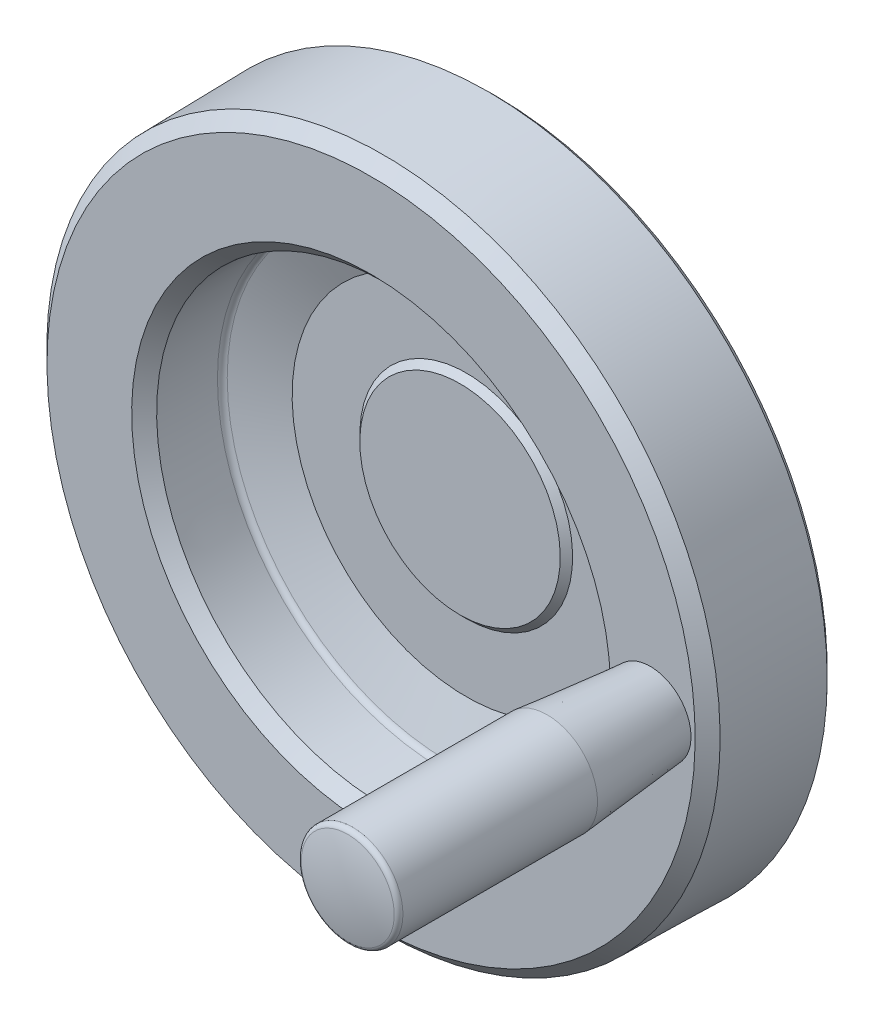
ISO-10303-21;
HEADER;
FILE_DESCRIPTION(('STEP AP214'),'2;1');
FILE_NAME('part.step','',(''),(''),'','','');
FILE_SCHEMA(('AUTOMOTIVE_DESIGN { 1 0 10303 214 1 1 1 1 }'));
ENDSEC;
DATA;
#1=APPLICATION_CONTEXT('core data for automotive mechanical design processes');
#2=APPLICATION_PROTOCOL_DEFINITION('international standard','automotive_design',2000,#1);
#3=PRODUCT_CONTEXT('',#1,'mechanical');
#4=PRODUCT('Part','Part','',(#3));
#5=PRODUCT_RELATED_PRODUCT_CATEGORY('part','',(#4));
#6=PRODUCT_DEFINITION_FORMATION('','',#4);
#7=PRODUCT_DEFINITION_CONTEXT('part definition',#1,'design');
#8=PRODUCT_DEFINITION('design','',#6,#7);
#9=PRODUCT_DEFINITION_SHAPE('','',#8);
#10=(LENGTH_UNIT() NAMED_UNIT(*) SI_UNIT(.MILLI.,.METRE.));
#11=(NAMED_UNIT(*) PLANE_ANGLE_UNIT() SI_UNIT($,.RADIAN.));
#12=(NAMED_UNIT(*) SI_UNIT($,.STERADIAN.) SOLID_ANGLE_UNIT());
#13=UNCERTAINTY_MEASURE_WITH_UNIT(LENGTH_MEASURE(1.E-05),#10,'distance_accuracy_value','');
#14=(GEOMETRIC_REPRESENTATION_CONTEXT(3) GLOBAL_UNCERTAINTY_ASSIGNED_CONTEXT((#13)) GLOBAL_UNIT_ASSIGNED_CONTEXT((#10,
#11,#12)) REPRESENTATION_CONTEXT('',''));
#15=CARTESIAN_POINT('',(0.,0.,0.));
#16=DIRECTION('',(0.,0.,1.));
#17=DIRECTION('',(1.,0.,0.));
#18=AXIS2_PLACEMENT_3D('',#15,#16,#17);
#19=CARTESIAN_POINT('',(72.5,0.,34.));
#20=DIRECTION('',(0.,0.,1.));
#21=DIRECTION('',(0.,1.,0.));
#22=AXIS2_PLACEMENT_3D('',#19,#20,#21);
#23=CYLINDRICAL_SURFACE('',#22,4.188);
#24=CARTESIAN_POINT('',(72.5,0.,49.1079999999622));
#25=DIRECTION('',(0.,0.,1.));
#26=DIRECTION('',(0.,1.,0.));
#27=AXIS2_PLACEMENT_3D('',#24,#25,#26);
#28=CIRCLE('',#27,4.188);
#29=CARTESIAN_POINT('',(72.5,4.188,49.1079999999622));
#30=VERTEX_POINT('',#29);
#31=EDGE_CURVE('E9',#30,#30,#28,.F.);
#32=ORIENTED_EDGE('',*,*,#31,.F.);
#33=EDGE_LOOP('',(#32));
#34=FACE_BOUND('',#33,.T.);
#35=CARTESIAN_POINT('',(72.5,0.,34.8119999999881));
#36=DIRECTION('',(0.,0.,-1.));
#37=DIRECTION('',(0.,-1.,0.));
#38=AXIS2_PLACEMENT_3D('',#35,#36,#37);
#39=CIRCLE('',#38,4.18800000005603);
#40=CARTESIAN_POINT('',(72.5,-4.18800000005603,34.8119999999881));
#41=VERTEX_POINT('',#40);
#42=EDGE_CURVE('E154',#41,#41,#39,.T.);
#43=ORIENTED_EDGE('',*,*,#42,.T.);
#44=EDGE_LOOP('',(#43));
#45=FACE_BOUND('',#44,.T.);
#46=ADVANCED_FACE('F15',(#34,#45),#23,.F.);
#47=CARTESIAN_POINT('',(72.5,0.,34.0000000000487));
#48=DIRECTION('',(0.,0.,-1.));
#49=DIRECTION('',(0.,-1.,0.));
#50=AXIS2_PLACEMENT_3D('',#47,#48,#49);
#51=CONICAL_SURFACE('',#50,4.99999999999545,0.785398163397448);
#52=ORIENTED_EDGE('',*,*,#42,.F.);
#53=EDGE_LOOP('',(#52));
#54=FACE_BOUND('',#53,.T.);
#55=CARTESIAN_POINT('',(72.5,0.,34.0000000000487));
#56=DIRECTION('',(0.,0.,-1.));
#57=DIRECTION('',(0.,-1.,0.));
#58=AXIS2_PLACEMENT_3D('',#55,#56,#57);
#59=CIRCLE('',#58,4.99999999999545);
#60=CARTESIAN_POINT('',(72.5,-4.99999999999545,34.0000000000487));
#61=VERTEX_POINT('',#60);
#62=EDGE_CURVE('E435',#61,#61,#59,.T.);
#63=ORIENTED_EDGE('',*,*,#62,.T.);
#64=EDGE_LOOP('',(#63));
#65=FACE_BOUND('',#64,.T.);
#66=ADVANCED_FACE('F405',(#54,#65),#51,.F.);
#67=CARTESIAN_POINT('',(-85.9279281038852,0.,34.));
#68=DIRECTION('',(0.,0.,1.));
#69=DIRECTION('',(0.,1.,0.));
#70=AXIS2_PLACEMENT_3D('',#67,#68,#69);
#71=PLANE('',#70);
#72=CARTESIAN_POINT('',(0.,0.,34.));
#73=DIRECTION('',(0.,0.,1.));
#74=DIRECTION('',(0.,1.,0.));
#75=AXIS2_PLACEMENT_3D('',#72,#73,#74);
#76=CIRCLE('',#75,85.9279281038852);
#77=CARTESIAN_POINT('',(0.,85.9279281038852,34.));
#78=VERTEX_POINT('',#77);
#79=EDGE_CURVE('E434',#78,#78,#76,.T.);
#80=ORIENTED_EDGE('',*,*,#79,.F.);
#81=EDGE_LOOP('',(#80));
#82=FACE_BOUND('',#81,.T.);
#83=ORIENTED_EDGE('',*,*,#62,.F.);
#84=EDGE_LOOP('',(#83));
#85=FACE_BOUND('',#84,.T.);
#86=CARTESIAN_POINT('',(0.,0.,34.));
#87=DIRECTION('',(0.,0.,1.));
#88=DIRECTION('',(0.,1.,0.));
#89=AXIS2_PLACEMENT_3D('',#86,#87,#88);
#90=CIRCLE('',#89,58.3333333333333);
#91=CARTESIAN_POINT('',(0.,58.3333333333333,34.));
#92=VERTEX_POINT('',#91);
#93=EDGE_CURVE('E148',#92,#92,#90,.F.);
#94=ORIENTED_EDGE('',*,*,#93,.F.);
#95=EDGE_LOOP('',(#94));
#96=FACE_BOUND('',#95,.T.);
#97=ADVANCED_FACE('F401',(#82,#85,#96),#71,.F.);
#98=CARTESIAN_POINT('',(-61.8780196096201,0.,66.));
#99=DIRECTION('',(0.,0.,-1.));
#100=DIRECTION('',(0.,-1.,0.));
#101=AXIS2_PLACEMENT_3D('',#98,#99,#100);
#102=PLANE('',#101);
#103=CARTESIAN_POINT('',(72.5,0.,66.));
#104=DIRECTION('',(0.,0.,-1.));
#105=DIRECTION('',(1.,0.,0.));
#106=AXIS2_PLACEMENT_3D('',#103,#104,#105);
#107=CIRCLE('',#106,6.5);
#108=CARTESIAN_POINT('',(79.,0.,66.));
#109=VERTEX_POINT('',#108);
#110=EDGE_CURVE('E330',#109,#109,#107,.F.);
#111=ORIENTED_EDGE('',*,*,#110,.F.);
#112=EDGE_LOOP('',(#111));
#113=FACE_BOUND('',#112,.T.);
#114=CARTESIAN_POINT('',(0.,0.,66.));
#115=DIRECTION('',(0.,0.,1.));
#116=DIRECTION('',(0.,1.,0.));
#117=AXIS2_PLACEMENT_3D('',#114,#115,#116);
#118=CIRCLE('',#117,61.8780196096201);
#119=CARTESIAN_POINT('',(0.,61.8780196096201,66.));
#120=VERTEX_POINT('',#119);
#121=EDGE_CURVE('E432',#120,#120,#118,.T.);
#122=ORIENTED_EDGE('',*,*,#121,.F.);
#123=EDGE_LOOP('',(#122));
#124=FACE_BOUND('',#123,.T.);
#125=CARTESIAN_POINT('',(0.,0.,66.));
#126=DIRECTION('',(0.,0.,-1.));
#127=DIRECTION('',(0.,-1.,0.));
#128=AXIS2_PLACEMENT_3D('',#125,#126,#127);
#129=CIRCLE('',#128,83.7693660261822);
#130=CARTESIAN_POINT('',(0.,-83.7693660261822,66.));
#131=VERTEX_POINT('',#130);
#132=EDGE_CURVE('E142',#131,#131,#129,.T.);
#133=ORIENTED_EDGE('',*,*,#132,.F.);
#134=EDGE_LOOP('',(#133));
#135=FACE_BOUND('',#134,.T.);
#136=ADVANCED_FACE('F398',(#113,#124,#135),#102,.F.);
#137=CARTESIAN_POINT('',(0.,0.,66.));
#138=DIRECTION('',(0.,0.,1.));
#139=DIRECTION('',(0.,1.,0.));
#140=AXIS2_PLACEMENT_3D('',#137,#138,#139);
#141=CONICAL_SURFACE('',#140,61.8780196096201,0.79412480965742);
#142=CARTESIAN_POINT('',(0.,0.,62.8004873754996));
#143=DIRECTION('',(0.,0.,1.));
#144=DIRECTION('',(0.,1.,0.));
#145=AXIS2_PLACEMENT_3D('',#142,#143,#144);
#146=CIRCLE('',#145,58.6221719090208);
#147=CARTESIAN_POINT('',(0.,58.6221719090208,62.8004873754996));
#148=VERTEX_POINT('',#147);
#149=EDGE_CURVE('E145',#148,#148,#146,.T.);
#150=ORIENTED_EDGE('',*,*,#149,.F.);
#151=EDGE_LOOP('',(#150));
#152=FACE_BOUND('',#151,.T.);
#153=ORIENTED_EDGE('',*,*,#121,.T.);
#154=EDGE_LOOP('',(#153));
#155=FACE_BOUND('',#154,.T.);
#156=ADVANCED_FACE('F392',(#152,#155),#141,.F.);
#157=CARTESIAN_POINT('',(0.,0.,62.8004873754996));
#158=DIRECTION('',(0.,0.,-1.));
#159=DIRECTION('',(0.,-1.,0.));
#160=AXIS2_PLACEMENT_3D('',#157,#158,#159);
#161=CONICAL_SURFACE('',#160,87.0252137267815,0.79412480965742);
#162=ORIENTED_EDGE('',*,*,#132,.T.);
#163=EDGE_LOOP('',(#162));
#164=FACE_BOUND('',#163,.T.);
#165=CARTESIAN_POINT('',(0.,0.,62.8004873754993));
#166=DIRECTION('',(0.,0.,-1.));
#167=DIRECTION('',(0.,-1.,0.));
#168=AXIS2_PLACEMENT_3D('',#165,#166,#167);
#169=CIRCLE('',#168,87.0252137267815);
#170=CARTESIAN_POINT('',(0.,-87.0252137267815,62.8004873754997));
#171=VERTEX_POINT('',#170);
#172=EDGE_CURVE('E134',#171,#171,#169,.T.);
#173=ORIENTED_EDGE('',*,*,#172,.F.);
#174=EDGE_LOOP('',(#173));
#175=FACE_BOUND('',#174,.T.);
#176=ADVANCED_FACE('F389',(#164,#175),#161,.T.);
#177=CARTESIAN_POINT('',(0.,0.,62.8004873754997));
#178=DIRECTION('',(0.,0.,1.));
#179=DIRECTION('',(0.,1.,0.));
#180=AXIS2_PLACEMENT_3D('',#177,#178,#179);
#181=CONICAL_SURFACE('',#180,58.6221719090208,0.0174532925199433);
#182=CARTESIAN_POINT('',(0.,0.,47.3524185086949));
#183=DIRECTION('',(0.,0.,1.));
#184=DIRECTION('',(0.,1.,0.));
#185=AXIS2_PLACEMENT_3D('',#182,#183,#184);
#186=CIRCLE('',#185,58.3525248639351);
#187=CARTESIAN_POINT('',(0.,58.3525248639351,47.352418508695));
#188=VERTEX_POINT('',#187);
#189=EDGE_CURVE('E164',#188,#188,#186,.T.);
#190=ORIENTED_EDGE('',*,*,#189,.F.);
#191=EDGE_LOOP('',(#190));
#192=FACE_BOUND('',#191,.T.);
#193=ORIENTED_EDGE('',*,*,#149,.T.);
#194=EDGE_LOOP('',(#193));
#195=FACE_BOUND('',#194,.T.);
#196=ADVANCED_FACE('F387',(#192,#195),#181,.F.);
#197=CARTESIAN_POINT('',(0.,0.,35.599756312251));
#198=DIRECTION('',(0.,0.,-1.));
#199=DIRECTION('',(0.,-1.,0.));
#200=AXIS2_PLACEMENT_3D('',#197,#198,#199);
#201=CONICAL_SURFACE('',#200,87.5000042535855,0.0174532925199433);
#202=ORIENTED_EDGE('',*,*,#172,.T.);
#203=EDGE_LOOP('',(#202));
#204=FACE_BOUND('',#203,.T.);
#205=CARTESIAN_POINT('',(0.,0.,35.5997563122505));
#206=DIRECTION('',(0.,0.,-1.));
#207=DIRECTION('',(0.,-1.,0.));
#208=AXIS2_PLACEMENT_3D('',#205,#206,#207);
#209=CIRCLE('',#208,87.5000042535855);
#210=CARTESIAN_POINT('',(0.,-87.5000042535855,35.5997563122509));
#211=VERTEX_POINT('',#210);
#212=EDGE_CURVE('E137',#211,#211,#209,.F.);
#213=ORIENTED_EDGE('',*,*,#212,.T.);
#214=EDGE_LOOP('',(#213));
#215=FACE_BOUND('',#214,.T.);
#216=ADVANCED_FACE('F189',(#204,#215),#201,.T.);
#217=CARTESIAN_POINT('',(0.,0.,47.3803423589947));
#218=DIRECTION('',(0.,0.,-1.));
#219=DIRECTION('',(0.,-1.,0.));
#220=AXIS2_PLACEMENT_3D('',#217,#218,#219);
#221=TOROIDAL_SURFACE('',#220,56.7527685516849,1.6);
#222=CARTESIAN_POINT('',(0.,0.,45.8768341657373));
#223=DIRECTION('',(0.,0.,-1.));
#224=DIRECTION('',(0.,-1.,0.));
#225=AXIS2_PLACEMENT_3D('',#222,#223,#224);
#226=CIRCLE('',#225,57.300000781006);
#227=CARTESIAN_POINT('',(0.,-57.300000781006,45.8768341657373));
#228=VERTEX_POINT('',#227);
#229=EDGE_CURVE('E196',#228,#228,#226,.F.);
#230=ORIENTED_EDGE('',*,*,#229,.F.);
#231=EDGE_LOOP('',(#230));
#232=FACE_BOUND('',#231,.T.);
#233=ORIENTED_EDGE('',*,*,#189,.T.);
#234=EDGE_LOOP('',(#233));
#235=FACE_BOUND('',#234,.T.);
#236=ADVANCED_FACE('F184',(#232,#235),#221,.F.);
#237=CARTESIAN_POINT('',(0.,0.,35.5997563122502));
#238=DIRECTION('',(0.,0.,1.));
#239=DIRECTION('',(0.,1.,0.));
#240=AXIS2_PLACEMENT_3D('',#237,#238,#239);
#241=CONICAL_SURFACE('',#240,87.5000042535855,0.77667151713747);
#242=ORIENTED_EDGE('',*,*,#212,.F.);
#243=EDGE_LOOP('',(#242));
#244=FACE_BOUND('',#243,.T.);
#245=ORIENTED_EDGE('',*,*,#79,.T.);
#246=EDGE_LOOP('',(#245));
#247=FACE_BOUND('',#246,.T.);
#248=ADVANCED_FACE('F188',(#244,#247),#241,.T.);
#249=CARTESIAN_POINT('',(0.,0.,0.));
#250=DIRECTION('',(0.,0.,1.));
#251=DIRECTION('',(0.,1.,0.));
#252=AXIS2_PLACEMENT_3D('',#249,#250,#251);
#253=CYLINDRICAL_SURFACE('',#252,58.3333333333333);
#254=ORIENTED_EDGE('',*,*,#93,.T.);
#255=EDGE_LOOP('',(#254));
#256=FACE_BOUND('',#255,.T.);
#257=CARTESIAN_POINT('',(0.,0.,37.2287187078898));
#258=DIRECTION('',(0.,0.,1.));
#259=DIRECTION('',(0.,1.,0.));
#260=AXIS2_PLACEMENT_3D('',#257,#258,#259);
#261=CIRCLE('',#260,58.3333333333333);
#262=CARTESIAN_POINT('',(0.,58.3333333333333,37.2287187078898));
#263=VERTEX_POINT('',#262);
#264=EDGE_CURVE('E159',#263,#263,#261,.F.);
#265=ORIENTED_EDGE('',*,*,#264,.F.);
#266=EDGE_LOOP('',(#265));
#267=FACE_BOUND('',#266,.T.);
#268=ADVANCED_FACE('F396',(#256,#267),#253,.F.);
#269=CARTESIAN_POINT('',(0.,0.,45.8768341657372));
#270=DIRECTION('',(0.,0.,1.));
#271=DIRECTION('',(0.,1.,0.));
#272=AXIS2_PLACEMENT_3D('',#269,#270,#271);
#273=CONICAL_SURFACE('',#272,57.300000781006,1.22173047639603);
#274=CARTESIAN_POINT('',(0.,0.,41.4));
#275=DIRECTION('',(0.,0.,1.));
#276=DIRECTION('',(0.,1.,0.));
#277=AXIS2_PLACEMENT_3D('',#274,#275,#276);
#278=CIRCLE('',#277,45.);
#279=CARTESIAN_POINT('',(0.,45.,41.4));
#280=VERTEX_POINT('',#279);
#281=EDGE_CURVE('E204',#280,#280,#278,.T.);
#282=ORIENTED_EDGE('',*,*,#281,.F.);
#283=EDGE_LOOP('',(#282));
#284=FACE_BOUND('',#283,.T.);
#285=ORIENTED_EDGE('',*,*,#229,.T.);
#286=EDGE_LOOP('',(#285));
#287=FACE_BOUND('',#286,.T.);
#288=ADVANCED_FACE('F181',(#284,#287),#273,.F.);
#289=CARTESIAN_POINT('',(0.,0.,37.2287187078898));
#290=DIRECTION('',(0.,0.,-1.));
#291=DIRECTION('',(0.,-1.,0.));
#292=AXIS2_PLACEMENT_3D('',#289,#290,#291);
#293=TOROIDAL_SURFACE('',#292,56.7333333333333,1.6);
#294=ORIENTED_EDGE('',*,*,#264,.T.);
#295=EDGE_LOOP('',(#294));
#296=FACE_BOUND('',#295,.T.);
#297=CARTESIAN_POINT('',(0.,0.,38.6143593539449));
#298=DIRECTION('',(0.,0.,-1.));
#299=DIRECTION('',(0.,-1.,0.));
#300=AXIS2_PLACEMENT_3D('',#297,#298,#299);
#301=CIRCLE('',#300,55.9333333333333);
#302=CARTESIAN_POINT('',(0.,-55.9333333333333,38.6143593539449));
#303=VERTEX_POINT('',#302);
#304=EDGE_CURVE('E169',#303,#303,#301,.T.);
#305=ORIENTED_EDGE('',*,*,#304,.F.);
#306=EDGE_LOOP('',(#305));
#307=FACE_BOUND('',#306,.T.);
#308=ADVANCED_FACE('F176',(#296,#307),#293,.F.);
#309=CARTESIAN_POINT('',(-27.5,0.,41.4));
#310=DIRECTION('',(0.,0.,-1.));
#311=DIRECTION('',(0.,-1.,0.));
#312=AXIS2_PLACEMENT_3D('',#309,#310,#311);
#313=PLANE('',#312);
#314=CARTESIAN_POINT('',(0.,0.,41.4));
#315=DIRECTION('',(0.,0.,-1.));
#316=DIRECTION('',(0.,-1.,0.));
#317=AXIS2_PLACEMENT_3D('',#314,#315,#316);
#318=CIRCLE('',#317,27.5);
#319=CARTESIAN_POINT('',(0.,-27.5,41.4));
#320=VERTEX_POINT('',#319);
#321=EDGE_CURVE('E447',#320,#320,#318,.F.);
#322=ORIENTED_EDGE('',*,*,#321,.F.);
#323=EDGE_LOOP('',(#322));
#324=FACE_BOUND('',#323,.T.);
#325=ORIENTED_EDGE('',*,*,#281,.T.);
#326=EDGE_LOOP('',(#325));
#327=FACE_BOUND('',#326,.T.);
#328=ADVANCED_FACE('F180',(#324,#327),#313,.F.);
#329=CARTESIAN_POINT('',(0.,0.,38.6143593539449));
#330=DIRECTION('',(0.,0.,1.));
#331=DIRECTION('',(0.,1.,0.));
#332=AXIS2_PLACEMENT_3D('',#329,#330,#331);
#333=CONICAL_SURFACE('',#332,55.9333333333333,1.0471975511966);
#334=ORIENTED_EDGE('',*,*,#304,.T.);
#335=EDGE_LOOP('',(#334));
#336=FACE_BOUND('',#335,.T.);
#337=CARTESIAN_POINT('',(0.,0.,22.9489220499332));
#338=DIRECTION('',(0.,0.,1.));
#339=DIRECTION('',(0.,1.,0.));
#340=AXIS2_PLACEMENT_3D('',#337,#338,#339);
#341=CIRCLE('',#340,28.8);
#342=CARTESIAN_POINT('',(0.,28.8,22.9489220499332));
#343=VERTEX_POINT('',#342);
#344=EDGE_CURVE('E199',#343,#343,#341,.T.);
#345=ORIENTED_EDGE('',*,*,#344,.T.);
#346=EDGE_LOOP('',(#345));
#347=FACE_BOUND('',#346,.T.);
#348=ADVANCED_FACE('F191',(#336,#347),#333,.T.);
#349=CARTESIAN_POINT('',(0.,0.,41.4));
#350=DIRECTION('',(0.,0.,-1.));
#351=DIRECTION('',(0.,-1.,0.));
#352=AXIS2_PLACEMENT_3D('',#349,#350,#351);
#353=CONICAL_SURFACE('',#352,27.5,0.785398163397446);
#354=CARTESIAN_POINT('',(0.,0.,43.));
#355=DIRECTION('',(0.,0.,-1.));
#356=DIRECTION('',(0.,-1.,0.));
#357=AXIS2_PLACEMENT_3D('',#354,#355,#356);
#358=CIRCLE('',#357,25.9);
#359=CARTESIAN_POINT('',(0.,-25.9,43.));
#360=VERTEX_POINT('',#359);
#361=EDGE_CURVE('E453',#360,#360,#358,.T.);
#362=ORIENTED_EDGE('',*,*,#361,.T.);
#363=EDGE_LOOP('',(#362));
#364=FACE_BOUND('',#363,.T.);
#365=ORIENTED_EDGE('',*,*,#321,.T.);
#366=EDGE_LOOP('',(#365));
#367=FACE_BOUND('',#366,.T.);
#368=ADVANCED_FACE('F216',(#364,#367),#353,.T.);
#369=CARTESIAN_POINT('',(0.,0.,21.563281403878));
#370=DIRECTION('',(0.,0.,-1.));
#371=DIRECTION('',(0.,-1.,0.));
#372=AXIS2_PLACEMENT_3D('',#369,#370,#371);
#373=TOROIDAL_SURFACE('',#372,29.6,1.6);
#374=ORIENTED_EDGE('',*,*,#344,.F.);
#375=EDGE_LOOP('',(#374));
#376=FACE_BOUND('',#375,.T.);
#377=CARTESIAN_POINT('',(0.,0.,21.563281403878));
#378=DIRECTION('',(0.,0.,-1.));
#379=DIRECTION('',(0.,-1.,0.));
#380=AXIS2_PLACEMENT_3D('',#377,#378,#379);
#381=CIRCLE('',#380,28.);
#382=CARTESIAN_POINT('',(0.,-28.,21.563281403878));
#383=VERTEX_POINT('',#382);
#384=EDGE_CURVE('E209',#383,#383,#381,.T.);
#385=ORIENTED_EDGE('',*,*,#384,.F.);
#386=EDGE_LOOP('',(#385));
#387=FACE_BOUND('',#386,.T.);
#388=ADVANCED_FACE('F212',(#376,#387),#373,.F.);
#389=CARTESIAN_POINT('',(0.,0.,43.));
#390=DIRECTION('',(0.,0.,-1.));
#391=DIRECTION('',(0.,-1.,0.));
#392=AXIS2_PLACEMENT_3D('',#389,#390,#391);
#393=PLANE('',#392);
#394=ORIENTED_EDGE('',*,*,#361,.F.);
#395=EDGE_LOOP('',(#394));
#396=FACE_BOUND('',#395,.T.);
#397=ADVANCED_FACE('F215',(#396),#393,.F.);
#398=CARTESIAN_POINT('',(0.,0.,0.));
#399=DIRECTION('',(0.,0.,1.));
#400=DIRECTION('',(0.,1.,0.));
#401=AXIS2_PLACEMENT_3D('',#398,#399,#400);
#402=CYLINDRICAL_SURFACE('',#401,28.);
#403=ORIENTED_EDGE('',*,*,#384,.T.);
#404=EDGE_LOOP('',(#403));
#405=FACE_BOUND('',#404,.T.);
#406=CARTESIAN_POINT('',(0.,0.,15.));
#407=DIRECTION('',(0.,0.,1.));
#408=DIRECTION('',(0.,1.,0.));
#409=AXIS2_PLACEMENT_3D('',#406,#407,#408);
#410=CIRCLE('',#409,28.);
#411=CARTESIAN_POINT('',(0.,28.,15.));
#412=VERTEX_POINT('',#411);
#413=EDGE_CURVE('E450',#412,#412,#410,.T.);
#414=ORIENTED_EDGE('',*,*,#413,.T.);
#415=EDGE_LOOP('',(#414));
#416=FACE_BOUND('',#415,.T.);
#417=ADVANCED_FACE('F221',(#405,#416),#402,.T.);
#418=CARTESIAN_POINT('',(-28.,0.,15.));
#419=DIRECTION('',(0.,0.,1.));
#420=DIRECTION('',(0.,1.,0.));
#421=AXIS2_PLACEMENT_3D('',#418,#419,#420);
#422=PLANE('',#421);
#423=ORIENTED_EDGE('',*,*,#413,.F.);
#424=EDGE_LOOP('',(#423));
#425=FACE_BOUND('',#424,.T.);
#426=CARTESIAN_POINT('',(0.,0.,15.));
#427=DIRECTION('',(0.,0.,1.));
#428=DIRECTION('',(0.,1.,0.));
#429=AXIS2_PLACEMENT_3D('',#426,#427,#428);
#430=CIRCLE('',#429,20.);
#431=CARTESIAN_POINT('',(0.,20.,15.));
#432=VERTEX_POINT('',#431);
#433=EDGE_CURVE('E456',#432,#432,#430,.F.);
#434=ORIENTED_EDGE('',*,*,#433,.F.);
#435=EDGE_LOOP('',(#434));
#436=FACE_BOUND('',#435,.T.);
#437=ADVANCED_FACE('F224',(#425,#436),#422,.F.);
#438=CARTESIAN_POINT('',(0.,0.,0.));
#439=DIRECTION('',(0.,0.,1.));
#440=DIRECTION('',(0.,1.,0.));
#441=AXIS2_PLACEMENT_3D('',#438,#439,#440);
#442=CYLINDRICAL_SURFACE('',#441,20.);
#443=ORIENTED_EDGE('',*,*,#433,.T.);
#444=EDGE_LOOP('',(#443));
#445=FACE_BOUND('',#444,.T.);
#446=CARTESIAN_POINT('',(0.,0.,0.75));
#447=DIRECTION('',(0.,0.,1.));
#448=DIRECTION('',(0.,1.,0.));
#449=AXIS2_PLACEMENT_3D('',#446,#447,#448);
#450=CIRCLE('',#449,20.);
#451=CARTESIAN_POINT('',(0.,20.,0.75));
#452=VERTEX_POINT('',#451);
#453=EDGE_CURVE('E458',#452,#452,#450,.T.);
#454=ORIENTED_EDGE('',*,*,#453,.T.);
#455=EDGE_LOOP('',(#454));
#456=FACE_BOUND('',#455,.T.);
#457=ADVANCED_FACE('F231',(#445,#456),#442,.T.);
#458=CARTESIAN_POINT('',(0.,0.,0.75));
#459=DIRECTION('',(0.,0.,1.));
#460=DIRECTION('',(0.,1.,0.));
#461=AXIS2_PLACEMENT_3D('',#458,#459,#460);
#462=CONICAL_SURFACE('',#461,20.,0.785398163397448);
#463=ORIENTED_EDGE('',*,*,#453,.F.);
#464=EDGE_LOOP('',(#463));
#465=FACE_BOUND('',#464,.T.);
#466=CARTESIAN_POINT('',(0.,0.,0.));
#467=DIRECTION('',(0.,0.,1.));
#468=DIRECTION('',(0.,1.,0.));
#469=AXIS2_PLACEMENT_3D('',#466,#467,#468);
#470=CIRCLE('',#469,19.25);
#471=CARTESIAN_POINT('',(0.,19.25,0.));
#472=VERTEX_POINT('',#471);
#473=EDGE_CURVE('E459',#472,#472,#470,.T.);
#474=ORIENTED_EDGE('',*,*,#473,.T.);
#475=EDGE_LOOP('',(#474));
#476=FACE_BOUND('',#475,.T.);
#477=ADVANCED_FACE('F237',(#465,#476),#462,.T.);
#478=CARTESIAN_POINT('',(-19.25,0.,0.));
#479=DIRECTION('',(0.,0.,1.));
#480=DIRECTION('',(0.,1.,0.));
#481=AXIS2_PLACEMENT_3D('',#478,#479,#480);
#482=PLANE('',#481);
#483=ORIENTED_EDGE('',*,*,#473,.F.);
#484=EDGE_LOOP('',(#483));
#485=FACE_BOUND('',#484,.T.);
#486=ADVANCED_FACE('F17',(#485),#482,.F.);
#487=CARTESIAN_POINT('',(72.5,0.,49.));
#488=DIRECTION('',(0.,0.,1.));
#489=DIRECTION('',(-1.,0.,0.));
#490=AXIS2_PLACEMENT_3D('',#487,#488,#489);
#491=PLANE('',#490);
#492=DIRECTION('',(0.866025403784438,-0.5,0.));
#493=VECTOR('',#492,1.);
#494=CARTESIAN_POINT('',(72.5,2.88675134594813,49.));
#495=LINE('',#494,#493);
#496=CARTESIAN_POINT('',(72.5,2.88675134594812,49.));
#497=VERTEX_POINT('',#496);
#498=CARTESIAN_POINT('',(75.,1.44337567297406,49.));
#499=VERTEX_POINT('',#498);
#500=EDGE_CURVE('E33',#497,#499,#495,.T.);
#501=ORIENTED_EDGE('',*,*,#500,.F.);
#502=DIRECTION('',(0.866025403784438,0.5,0.));
#503=VECTOR('',#502,1.);
#504=CARTESIAN_POINT('',(70.,1.44337567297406,49.));
#505=LINE('',#504,#503);
#506=CARTESIAN_POINT('',(70.,1.44337567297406,49.));
#507=VERTEX_POINT('',#506);
#508=EDGE_CURVE('E278',#507,#497,#505,.T.);
#509=ORIENTED_EDGE('',*,*,#508,.F.);
#510=DIRECTION('',(0.,-1.,0.));
#511=VECTOR('',#510,1.);
#512=CARTESIAN_POINT('',(70.,0.,49.));
#513=LINE('',#512,#511);
#514=CARTESIAN_POINT('',(70.,-1.44337567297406,49.));
#515=VERTEX_POINT('',#514);
#516=EDGE_CURVE('E280',#515,#507,#513,.F.);
#517=ORIENTED_EDGE('',*,*,#516,.F.);
#518=DIRECTION('',(-0.866025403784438,0.5,0.));
#519=VECTOR('',#518,1.);
#520=CARTESIAN_POINT('',(72.5,-2.88675134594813,49.));
#521=LINE('',#520,#519);
#522=CARTESIAN_POINT('',(72.5,-2.88675134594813,49.));
#523=VERTEX_POINT('',#522);
#524=EDGE_CURVE('E282',#523,#515,#521,.T.);
#525=ORIENTED_EDGE('',*,*,#524,.F.);
#526=DIRECTION('',(-0.866025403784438,-0.5,0.));
#527=VECTOR('',#526,1.);
#528=CARTESIAN_POINT('',(75.,-1.44337567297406,49.));
#529=LINE('',#528,#527);
#530=CARTESIAN_POINT('',(75.,-1.44337567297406,49.));
#531=VERTEX_POINT('',#530);
#532=EDGE_CURVE('E284',#531,#523,#529,.T.);
#533=ORIENTED_EDGE('',*,*,#532,.F.);
#534=DIRECTION('',(0.,-1.,0.));
#535=VECTOR('',#534,1.);
#536=CARTESIAN_POINT('',(75.,0.,49.));
#537=LINE('',#536,#535);
#538=EDGE_CURVE('E273',#499,#531,#537,.T.);
#539=ORIENTED_EDGE('',*,*,#538,.F.);
#540=EDGE_LOOP('',(#501,#509,#517,#525,#533,#539));
#541=FACE_BOUND('',#540,.T.);
#542=CARTESIAN_POINT('',(72.5,0.,49.));
#543=DIRECTION('',(0.,0.,1.));
#544=DIRECTION('',(-1.,0.,0.));
#545=AXIS2_PLACEMENT_3D('',#542,#543,#544);
#546=CIRCLE('',#545,4.0800000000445);
#547=CARTESIAN_POINT('',(68.4199999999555,0.,49.));
#548=VERTEX_POINT('',#547);
#549=EDGE_CURVE('E276',#548,#548,#546,.T.);
#550=ORIENTED_EDGE('',*,*,#549,.F.);
#551=EDGE_LOOP('',(#550));
#552=FACE_BOUND('',#551,.T.);
#553=ADVANCED_FACE('F245',(#541,#552),#491,.F.);
#554=CARTESIAN_POINT('',(75.,-1.44337567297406,53.25));
#555=DIRECTION('',(-1.,0.,0.));
#556=DIRECTION('',(0.,0.,-1.));
#557=AXIS2_PLACEMENT_3D('',#554,#555,#556);
#558=PLANE('',#557);
#559=DIRECTION('',(0.,-1.,0.));
#560=VECTOR('',#559,1.);
#561=CARTESIAN_POINT('',(75.,0.,53.25));
#562=LINE('',#561,#560);
#563=CARTESIAN_POINT('',(74.9999999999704,0.,53.2500000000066));
#564=VERTEX_POINT('',#563);
#565=CARTESIAN_POINT('',(75.,1.44337567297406,53.25));
#566=VERTEX_POINT('',#565);
#567=EDGE_CURVE('E99',#564,#566,#562,.F.);
#568=ORIENTED_EDGE('',*,*,#567,.T.);
#569=DIRECTION('',(0.,0.,-1.));
#570=VECTOR('',#569,1.);
#571=CARTESIAN_POINT('',(75.,1.44337567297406,53.25));
#572=LINE('',#571,#570);
#573=EDGE_CURVE('E97',#566,#499,#572,.T.);
#574=ORIENTED_EDGE('',*,*,#573,.T.);
#575=ORIENTED_EDGE('',*,*,#538,.T.);
#576=DIRECTION('',(0.,0.,-1.));
#577=VECTOR('',#576,1.);
#578=CARTESIAN_POINT('',(75.,-1.44337567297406,53.25));
#579=LINE('',#578,#577);
#580=CARTESIAN_POINT('',(75.,-1.44337567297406,53.25));
#581=VERTEX_POINT('',#580);
#582=EDGE_CURVE('E310',#531,#581,#579,.F.);
#583=ORIENTED_EDGE('',*,*,#582,.T.);
#584=DIRECTION('',(0.,-1.,0.));
#585=VECTOR('',#584,1.);
#586=CARTESIAN_POINT('',(75.,0.,53.25));
#587=LINE('',#586,#585);
#588=EDGE_CURVE('E87',#581,#564,#587,.F.);
#589=ORIENTED_EDGE('',*,*,#588,.T.);
#590=EDGE_LOOP('',(#568,#574,#575,#583,#589));
#591=FACE_BOUND('',#590,.T.);
#592=ADVANCED_FACE('F549',(#591),#558,.T.);
#593=CARTESIAN_POINT('',(75.,1.44337567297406,53.25));
#594=DIRECTION('',(-0.5,-0.866025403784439,0.));
#595=DIRECTION('',(0.866025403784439,-0.5,0.));
#596=AXIS2_PLACEMENT_3D('',#593,#594,#595);
#597=PLANE('',#596);
#598=DIRECTION('',(-0.866025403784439,0.5,0.));
#599=VECTOR('',#598,1.);
#600=CARTESIAN_POINT('',(73.75,2.1650635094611,53.25));
#601=LINE('',#600,#599);
#602=CARTESIAN_POINT('',(73.7499999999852,2.1650635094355,53.2500000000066));
#603=VERTEX_POINT('',#602);
#604=CARTESIAN_POINT('',(72.5,2.88675134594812,53.25));
#605=VERTEX_POINT('',#604);
#606=EDGE_CURVE('E95',#603,#605,#601,.T.);
#607=ORIENTED_EDGE('',*,*,#606,.T.);
#608=DIRECTION('',(0.,0.,1.));
#609=VECTOR('',#608,1.);
#610=CARTESIAN_POINT('',(72.5,2.88675134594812,53.25));
#611=LINE('',#610,#609);
#612=EDGE_CURVE('E312',#605,#497,#611,.F.);
#613=ORIENTED_EDGE('',*,*,#612,.T.);
#614=ORIENTED_EDGE('',*,*,#500,.T.);
#615=ORIENTED_EDGE('',*,*,#573,.F.);
#616=DIRECTION('',(-0.866025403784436,0.5,0.));
#617=VECTOR('',#616,1.);
#618=CARTESIAN_POINT('',(75.,1.44337567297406,53.25));
#619=LINE('',#618,#617);
#620=EDGE_CURVE('E91',#566,#603,#619,.T.);
#621=ORIENTED_EDGE('',*,*,#620,.T.);
#622=EDGE_LOOP('',(#607,#613,#614,#615,#621));
#623=FACE_BOUND('',#622,.T.);
#624=ADVANCED_FACE('F93',(#623),#597,.T.);
#625=CARTESIAN_POINT('',(72.5,2.88675134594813,53.25));
#626=DIRECTION('',(0.5,-0.866025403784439,0.));
#627=DIRECTION('',(0.866025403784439,0.5,0.));
#628=AXIS2_PLACEMENT_3D('',#625,#626,#627);
#629=PLANE('',#628);
#630=DIRECTION('',(-0.866025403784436,-0.5,0.));
#631=VECTOR('',#630,1.);
#632=CARTESIAN_POINT('',(71.25,2.1650635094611,53.25));
#633=LINE('',#632,#631);
#634=CARTESIAN_POINT('',(71.2500000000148,2.1650635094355,53.2500000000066));
#635=VERTEX_POINT('',#634);
#636=CARTESIAN_POINT('',(70.,1.44337567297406,53.25));
#637=VERTEX_POINT('',#636);
#638=EDGE_CURVE('E306',#635,#637,#633,.T.);
#639=ORIENTED_EDGE('',*,*,#638,.T.);
#640=DIRECTION('',(0.,0.,1.));
#641=VECTOR('',#640,1.);
#642=CARTESIAN_POINT('',(70.,1.44337567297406,53.25));
#643=LINE('',#642,#641);
#644=EDGE_CURVE('E315',#637,#507,#643,.F.);
#645=ORIENTED_EDGE('',*,*,#644,.T.);
#646=ORIENTED_EDGE('',*,*,#508,.T.);
#647=ORIENTED_EDGE('',*,*,#612,.F.);
#648=DIRECTION('',(-0.866025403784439,-0.5,0.));
#649=VECTOR('',#648,1.);
#650=CARTESIAN_POINT('',(72.5,2.88675134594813,53.25));
#651=LINE('',#650,#649);
#652=EDGE_CURVE('E115',#605,#635,#651,.T.);
#653=ORIENTED_EDGE('',*,*,#652,.T.);
#654=EDGE_LOOP('',(#639,#645,#646,#647,#653));
#655=FACE_BOUND('',#654,.T.);
#656=ADVANCED_FACE('F367',(#655),#629,.T.);
#657=CARTESIAN_POINT('',(70.,1.44337567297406,53.25));
#658=DIRECTION('',(1.,0.,0.));
#659=DIRECTION('',(0.,0.,1.));
#660=AXIS2_PLACEMENT_3D('',#657,#658,#659);
#661=PLANE('',#660);
#662=DIRECTION('',(0.,-1.,0.));
#663=VECTOR('',#662,1.);
#664=CARTESIAN_POINT('',(70.,0.,53.25));
#665=LINE('',#664,#663);
#666=CARTESIAN_POINT('',(70.0000000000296,0.,53.2500000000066));
#667=VERTEX_POINT('',#666);
#668=CARTESIAN_POINT('',(70.,-1.44337567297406,53.25));
#669=VERTEX_POINT('',#668);
#670=EDGE_CURVE('E302',#667,#669,#665,.T.);
#671=ORIENTED_EDGE('',*,*,#670,.T.);
#672=DIRECTION('',(0.,0.,1.));
#673=VECTOR('',#672,1.);
#674=CARTESIAN_POINT('',(70.,-1.44337567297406,53.25));
#675=LINE('',#674,#673);
#676=EDGE_CURVE('E293',#669,#515,#675,.F.);
#677=ORIENTED_EDGE('',*,*,#676,.T.);
#678=ORIENTED_EDGE('',*,*,#516,.T.);
#679=ORIENTED_EDGE('',*,*,#644,.F.);
#680=DIRECTION('',(0.,-1.,0.));
#681=VECTOR('',#680,1.);
#682=CARTESIAN_POINT('',(70.,0.,53.25));
#683=LINE('',#682,#681);
#684=EDGE_CURVE('E304',#637,#667,#683,.T.);
#685=ORIENTED_EDGE('',*,*,#684,.T.);
#686=EDGE_LOOP('',(#671,#677,#678,#679,#685));
#687=FACE_BOUND('',#686,.T.);
#688=ADVANCED_FACE('F359',(#687),#661,.T.);
#689=CARTESIAN_POINT('',(70.,-1.44337567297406,53.25));
#690=DIRECTION('',(0.5,0.866025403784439,0.));
#691=DIRECTION('',(-0.866025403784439,0.5,0.));
#692=AXIS2_PLACEMENT_3D('',#689,#690,#691);
#693=PLANE('',#692);
#694=DIRECTION('',(-0.866025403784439,0.5,0.));
#695=VECTOR('',#694,1.);
#696=CARTESIAN_POINT('',(70.,-1.44337567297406,53.25));
#697=LINE('',#696,#695);
#698=CARTESIAN_POINT('',(71.2500000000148,-2.1650635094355,53.2500000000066));
#699=VERTEX_POINT('',#698);
#700=CARTESIAN_POINT('',(72.5,-2.88675134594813,53.25));
#701=VERTEX_POINT('',#700);
#702=EDGE_CURVE('E286',#699,#701,#697,.F.);
#703=ORIENTED_EDGE('',*,*,#702,.T.);
#704=DIRECTION('',(0.,0.,1.));
#705=VECTOR('',#704,1.);
#706=CARTESIAN_POINT('',(72.5,-2.88675134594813,53.25));
#707=LINE('',#706,#705);
#708=EDGE_CURVE('E289',#701,#523,#707,.F.);
#709=ORIENTED_EDGE('',*,*,#708,.T.);
#710=ORIENTED_EDGE('',*,*,#524,.T.);
#711=ORIENTED_EDGE('',*,*,#676,.F.);
#712=DIRECTION('',(0.866025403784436,-0.5,0.));
#713=VECTOR('',#712,1.);
#714=CARTESIAN_POINT('',(70.,-1.44337567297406,53.25));
#715=LINE('',#714,#713);
#716=EDGE_CURVE('E300',#669,#699,#715,.T.);
#717=ORIENTED_EDGE('',*,*,#716,.T.);
#718=EDGE_LOOP('',(#703,#709,#710,#711,#717));
#719=FACE_BOUND('',#718,.T.);
#720=ADVANCED_FACE('F354',(#719),#693,.T.);
#721=CARTESIAN_POINT('',(72.5,-2.88675134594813,53.25));
#722=DIRECTION('',(-0.5,0.866025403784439,0.));
#723=DIRECTION('',(-0.866025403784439,-0.5,0.));
#724=AXIS2_PLACEMENT_3D('',#721,#722,#723);
#725=PLANE('',#724);
#726=DIRECTION('',(0.866025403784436,0.5,0.));
#727=VECTOR('',#726,1.);
#728=CARTESIAN_POINT('',(73.75,-2.1650635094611,53.25));
#729=LINE('',#728,#727);
#730=CARTESIAN_POINT('',(73.7499999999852,-2.1650635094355,53.2500000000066));
#731=VERTEX_POINT('',#730);
#732=EDGE_CURVE('E298',#731,#581,#729,.T.);
#733=ORIENTED_EDGE('',*,*,#732,.T.);
#734=ORIENTED_EDGE('',*,*,#582,.F.);
#735=ORIENTED_EDGE('',*,*,#532,.T.);
#736=ORIENTED_EDGE('',*,*,#708,.F.);
#737=DIRECTION('',(-0.866025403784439,-0.5,0.));
#738=VECTOR('',#737,1.);
#739=CARTESIAN_POINT('',(72.5,-2.88675134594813,53.25));
#740=LINE('',#739,#738);
#741=EDGE_CURVE('E290',#701,#731,#740,.F.);
#742=ORIENTED_EDGE('',*,*,#741,.T.);
#743=EDGE_LOOP('',(#733,#734,#735,#736,#742));
#744=FACE_BOUND('',#743,.T.);
#745=ADVANCED_FACE('F590',(#744),#725,.T.);
#746=CARTESIAN_POINT('',(72.5,0.,53.25));
#747=DIRECTION('',(0.,0.,1.));
#748=DIRECTION('',(-1.,0.,0.));
#749=AXIS2_PLACEMENT_3D('',#746,#747,#748);
#750=PLANE('',#749);
#751=ORIENTED_EDGE('',*,*,#741,.F.);
#752=ORIENTED_EDGE('',*,*,#702,.F.);
#753=CARTESIAN_POINT('',(72.5,0.,53.2500000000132));
#754=DIRECTION('',(0.,0.,-1.));
#755=DIRECTION('',(1.,0.,0.));
#756=AXIS2_PLACEMENT_3D('',#753,#754,#755);
#757=CIRCLE('',#756,2.49999999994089);
#758=EDGE_CURVE('E296',#731,#699,#757,.T.);
#759=ORIENTED_EDGE('',*,*,#758,.F.);
#760=EDGE_LOOP('',(#751,#752,#759));
#761=FACE_BOUND('',#760,.T.);
#762=ADVANCED_FACE('F351',(#761),#750,.F.);
#763=CARTESIAN_POINT('',(72.5,0.,53.2500000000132));
#764=DIRECTION('',(0.,0.,-1.));
#765=DIRECTION('',(1.,0.,0.));
#766=AXIS2_PLACEMENT_3D('',#763,#764,#765);
#767=CONICAL_SURFACE('',#766,2.49999999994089,1.04719755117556);
#768=CARTESIAN_POINT('',(72.4999999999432,0.,54.6933756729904));
#769=VERTEX_POINT('',#768);
#770=VERTEX_LOOP('',#769);
#771=FACE_BOUND('',#770,.T.);
#772=ORIENTED_EDGE('',*,*,#758,.T.);
#773=CARTESIAN_POINT('',(72.5,0.,53.2500000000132));
#774=DIRECTION('',(0.,0.,-1.));
#775=DIRECTION('',(1.,0.,0.));
#776=AXIS2_PLACEMENT_3D('',#773,#774,#775);
#777=CIRCLE('',#776,2.49999999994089);
#778=EDGE_CURVE('E124',#667,#699,#777,.F.);
#779=ORIENTED_EDGE('',*,*,#778,.F.);
#780=CARTESIAN_POINT('',(72.5,0.,53.2500000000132));
#781=DIRECTION('',(0.,0.,-1.));
#782=DIRECTION('',(1.,0.,0.));
#783=AXIS2_PLACEMENT_3D('',#780,#781,#782);
#784=CIRCLE('',#783,2.49999999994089);
#785=EDGE_CURVE('E122',#635,#667,#784,.F.);
#786=ORIENTED_EDGE('',*,*,#785,.F.);
#787=CARTESIAN_POINT('',(72.5,0.,53.2500000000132));
#788=DIRECTION('',(0.,0.,-1.));
#789=DIRECTION('',(1.,0.,0.));
#790=AXIS2_PLACEMENT_3D('',#787,#788,#789);
#791=CIRCLE('',#790,2.49999999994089);
#792=EDGE_CURVE('E108',#603,#635,#791,.F.);
#793=ORIENTED_EDGE('',*,*,#792,.F.);
#794=CARTESIAN_POINT('',(72.5,0.,53.2500000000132));
#795=DIRECTION('',(0.,0.,-1.));
#796=DIRECTION('',(1.,0.,0.));
#797=AXIS2_PLACEMENT_3D('',#794,#795,#796);
#798=CIRCLE('',#797,2.49999999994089);
#799=EDGE_CURVE('E102',#564,#603,#798,.F.);
#800=ORIENTED_EDGE('',*,*,#799,.F.);
#801=CARTESIAN_POINT('',(72.5,0.,53.2500000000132));
#802=DIRECTION('',(0.,0.,-1.));
#803=DIRECTION('',(1.,0.,0.));
#804=AXIS2_PLACEMENT_3D('',#801,#802,#803);
#805=CIRCLE('',#804,2.49999999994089);
#806=EDGE_CURVE('E342',#731,#564,#805,.F.);
#807=ORIENTED_EDGE('',*,*,#806,.F.);
#808=EDGE_LOOP('',(#772,#779,#786,#793,#800,#807));
#809=FACE_BOUND('',#808,.T.);
#810=ADVANCED_FACE('F119',(#771,#809),#767,.F.);
#811=CARTESIAN_POINT('',(72.5,0.,53.25));
#812=DIRECTION('',(0.,0.,1.));
#813=DIRECTION('',(-1.,0.,0.));
#814=AXIS2_PLACEMENT_3D('',#811,#812,#813);
#815=PLANE('',#814);
#816=ORIENTED_EDGE('',*,*,#588,.F.);
#817=ORIENTED_EDGE('',*,*,#732,.F.);
#818=ORIENTED_EDGE('',*,*,#806,.T.);
#819=EDGE_LOOP('',(#816,#817,#818));
#820=FACE_BOUND('',#819,.T.);
#821=ADVANCED_FACE('F378',(#820),#815,.F.);
#822=CARTESIAN_POINT('',(72.5,0.,53.25));
#823=DIRECTION('',(0.,0.,1.));
#824=DIRECTION('',(-1.,0.,0.));
#825=AXIS2_PLACEMENT_3D('',#822,#823,#824);
#826=PLANE('',#825);
#827=ORIENTED_EDGE('',*,*,#716,.F.);
#828=ORIENTED_EDGE('',*,*,#670,.F.);
#829=ORIENTED_EDGE('',*,*,#778,.T.);
#830=EDGE_LOOP('',(#827,#828,#829));
#831=FACE_BOUND('',#830,.T.);
#832=ADVANCED_FACE('F347',(#831),#826,.F.);
#833=CARTESIAN_POINT('',(72.5,0.,53.25));
#834=DIRECTION('',(0.,0.,1.));
#835=DIRECTION('',(-1.,0.,0.));
#836=AXIS2_PLACEMENT_3D('',#833,#834,#835);
#837=PLANE('',#836);
#838=ORIENTED_EDGE('',*,*,#684,.F.);
#839=ORIENTED_EDGE('',*,*,#638,.F.);
#840=ORIENTED_EDGE('',*,*,#785,.T.);
#841=EDGE_LOOP('',(#838,#839,#840));
#842=FACE_BOUND('',#841,.T.);
#843=ADVANCED_FACE('F370',(#842),#837,.F.);
#844=CARTESIAN_POINT('',(72.5,0.,53.25));
#845=DIRECTION('',(0.,0.,1.));
#846=DIRECTION('',(-1.,0.,0.));
#847=AXIS2_PLACEMENT_3D('',#844,#845,#846);
#848=PLANE('',#847);
#849=ORIENTED_EDGE('',*,*,#652,.F.);
#850=ORIENTED_EDGE('',*,*,#606,.F.);
#851=ORIENTED_EDGE('',*,*,#792,.T.);
#852=EDGE_LOOP('',(#849,#850,#851));
#853=FACE_BOUND('',#852,.T.);
#854=ADVANCED_FACE('F113',(#853),#848,.F.);
#855=CARTESIAN_POINT('',(72.5,0.,53.25));
#856=DIRECTION('',(0.,0.,1.));
#857=DIRECTION('',(-1.,0.,0.));
#858=AXIS2_PLACEMENT_3D('',#855,#856,#857);
#859=PLANE('',#858);
#860=ORIENTED_EDGE('',*,*,#620,.F.);
#861=ORIENTED_EDGE('',*,*,#567,.F.);
#862=ORIENTED_EDGE('',*,*,#799,.T.);
#863=EDGE_LOOP('',(#860,#861,#862));
#864=FACE_BOUND('',#863,.T.);
#865=ADVANCED_FACE('F103',(#864),#859,.F.);
#866=CARTESIAN_POINT('',(72.5,0.,49.919999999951));
#867=DIRECTION('',(0.,0.,1.));
#868=DIRECTION('',(-1.,0.,0.));
#869=AXIS2_PLACEMENT_3D('',#866,#867,#868);
#870=CONICAL_SURFACE('',#869,4.99999999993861,0.785398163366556);
#871=ORIENTED_EDGE('',*,*,#549,.T.);
#872=EDGE_LOOP('',(#871));
#873=FACE_BOUND('',#872,.T.);
#874=ORIENTED_EDGE('',*,*,#31,.T.);
#875=EDGE_LOOP('',(#874));
#876=FACE_BOUND('',#875,.T.);
#877=ADVANCED_FACE('F384',(#873,#876),#870,.T.);
#878=CARTESIAN_POINT('',(72.5,0.,146.));
#879=DIRECTION('',(0.,0.,-1.));
#880=DIRECTION('',(1.,0.,0.));
#881=AXIS2_PLACEMENT_3D('',#878,#879,#880);
#882=CYLINDRICAL_SURFACE('',#881,6.5);
#883=ORIENTED_EDGE('',*,*,#110,.T.);
#884=EDGE_LOOP('',(#883));
#885=FACE_BOUND('',#884,.T.);
#886=CARTESIAN_POINT('',(72.5,0.,66.3));
#887=DIRECTION('',(0.,0.,-1.));
#888=DIRECTION('',(1.,0.,0.));
#889=AXIS2_PLACEMENT_3D('',#886,#887,#888);
#890=CIRCLE('',#889,6.5);
#891=CARTESIAN_POINT('',(79.,0.,66.3));
#892=VERTEX_POINT('',#891);
#893=EDGE_CURVE('E327',#892,#892,#890,.T.);
#894=ORIENTED_EDGE('',*,*,#893,.T.);
#895=EDGE_LOOP('',(#894));
#896=FACE_BOUND('',#895,.T.);
#897=ADVANCED_FACE('F247',(#885,#896),#882,.T.);
#898=CARTESIAN_POINT('',(72.5,-6.5,66.3));
#899=DIRECTION('',(0.,0.,1.));
#900=DIRECTION('',(-1.,0.,0.));
#901=AXIS2_PLACEMENT_3D('',#898,#899,#900);
#902=PLANE('',#901);
#903=ORIENTED_EDGE('',*,*,#893,.F.);
#904=EDGE_LOOP('',(#903));
#905=FACE_BOUND('',#904,.T.);
#906=CARTESIAN_POINT('',(72.5,0.,66.3));
#907=DIRECTION('',(0.,0.,1.));
#908=DIRECTION('',(-1.,0.,0.));
#909=AXIS2_PLACEMENT_3D('',#906,#907,#908);
#910=CIRCLE('',#909,10.5);
#911=CARTESIAN_POINT('',(62.,0.,66.3));
#912=VERTEX_POINT('',#911);
#913=EDGE_CURVE('E320',#912,#912,#910,.T.);
#914=ORIENTED_EDGE('',*,*,#913,.F.);
#915=EDGE_LOOP('',(#914));
#916=FACE_BOUND('',#915,.T.);
#917=ADVANCED_FACE('F266',(#905,#916),#902,.F.);
#918=CARTESIAN_POINT('',(72.5,0.,92.9666666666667));
#919=DIRECTION('',(0.,0.,1.));
#920=DIRECTION('',(-1.,0.,0.));
#921=AXIS2_PLACEMENT_3D('',#918,#919,#920);
#922=CONICAL_SURFACE('',#921,13.,0.0934767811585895);
#923=ORIENTED_EDGE('',*,*,#913,.T.);
#924=EDGE_LOOP('',(#923));
#925=FACE_BOUND('',#924,.T.);
#926=CARTESIAN_POINT('',(72.5,0.,92.9666666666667));
#927=DIRECTION('',(0.,0.,-1.));
#928=DIRECTION('',(1.,0.,0.));
#929=AXIS2_PLACEMENT_3D('',#926,#927,#928);
#930=CIRCLE('',#929,13.);
#931=CARTESIAN_POINT('',(85.5,0.,92.9666666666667));
#932=VERTEX_POINT('',#931);
#933=EDGE_CURVE('E131',#932,#932,#930,.F.);
#934=ORIENTED_EDGE('',*,*,#933,.F.);
#935=EDGE_LOOP('',(#934));
#936=FACE_BOUND('',#935,.T.);
#937=ADVANCED_FACE('F672',(#925,#936),#922,.T.);
#938=CARTESIAN_POINT('',(72.5,0.,146.));
#939=DIRECTION('',(0.,0.,-1.));
#940=DIRECTION('',(1.,0.,0.));
#941=AXIS2_PLACEMENT_3D('',#938,#939,#940);
#942=CYLINDRICAL_SURFACE('',#941,13.);
#943=ORIENTED_EDGE('',*,*,#933,.T.);
#944=EDGE_LOOP('',(#943));
#945=FACE_BOUND('',#944,.T.);
#946=CARTESIAN_POINT('',(72.5,0.,143.262009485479));
#947=DIRECTION('',(0.,0.,-1.));
#948=DIRECTION('',(1.,0.,0.));
#949=AXIS2_PLACEMENT_3D('',#946,#947,#948);
#950=CIRCLE('',#949,13.);
#951=CARTESIAN_POINT('',(85.5,0.,143.262009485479));
#952=VERTEX_POINT('',#951);
#953=EDGE_CURVE('E323',#952,#952,#950,.T.);
#954=ORIENTED_EDGE('',*,*,#953,.T.);
#955=EDGE_LOOP('',(#954));
#956=FACE_BOUND('',#955,.T.);
#957=ADVANCED_FACE('F259',(#945,#956),#942,.T.);
#958=CARTESIAN_POINT('',(72.5,0.,143.262009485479));
#959=DIRECTION('',(0.,0.,1.));
#960=DIRECTION('',(-1.,0.,0.));
#961=AXIS2_PLACEMENT_3D('',#958,#959,#960);
#962=TOROIDAL_SURFACE('',#961,11.7,1.3);
#963=CARTESIAN_POINT('',(72.5,0.,144.523319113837));
#964=DIRECTION('',(0.,0.,1.));
#965=DIRECTION('',(-1.,0.,0.));
#966=AXIS2_PLACEMENT_3D('',#963,#964,#965);
#967=CIRCLE('',#966,12.0147983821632);
#968=CARTESIAN_POINT('',(60.4852016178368,0.,144.523319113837));
#969=VERTEX_POINT('',#968);
#970=EDGE_CURVE('E324',#969,#969,#967,.F.);
#971=ORIENTED_EDGE('',*,*,#970,.T.);
#972=EDGE_LOOP('',(#971));
#973=FACE_BOUND('',#972,.T.);
#974=ORIENTED_EDGE('',*,*,#953,.F.);
#975=EDGE_LOOP('',(#974));
#976=FACE_BOUND('',#975,.T.);
#977=ADVANCED_FACE('F252',(#973,#976),#962,.T.);
#978=CARTESIAN_POINT('',(72.5,1.45369595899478E-13,96.3833333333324));
#979=DIRECTION('',(0.,-1.,0.));
#980=DIRECTION('',(1.,0.,0.));
#981=AXIS2_PLACEMENT_3D('',#978,#979,#980);
#982=SPHERICAL_SURFACE('',#981,49.6166666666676);
#983=ORIENTED_EDGE('',*,*,#970,.F.);
#984=EDGE_LOOP('',(#983));
#985=FACE_BOUND('',#984,.T.);
#986=ADVANCED_FACE('F250',(#985),#982,.T.);
#987=CLOSED_SHELL('',(#46,#66,#97,#136,#156,#176,#196,#216,#236,#248,#268,#288,#308,#328,#348,
#368,#388,#397,#417,#437,#457,#477,#486,#553,#592,#624,#656,#688,#720,#745,#762,#810,#821,#832,
#843,#854,#865,#877,#897,#917,#937,#957,#977,#986));
#988=CARTESIAN_POINT('',(72.5,0.,89.));
#989=DIRECTION('',(0.,0.,-1.));
#990=DIRECTION('',(1.,0.,0.));
#991=AXIS2_PLACEMENT_3D('',#988,#989,#990);
#992=CYLINDRICAL_SURFACE('',#991,3.672);
#993=CARTESIAN_POINT('',(72.5,0.,62.6));
#994=DIRECTION('',(0.,0.,-1.));
#995=DIRECTION('',(1.,0.,0.));
#996=AXIS2_PLACEMENT_3D('',#993,#994,#995);
#997=CIRCLE('',#996,3.672);
#998=CARTESIAN_POINT('',(76.172,0.,62.6));
#999=VERTEX_POINT('',#998);
#1000=EDGE_CURVE('E336',#999,#999,#997,.F.);
#1001=ORIENTED_EDGE('',*,*,#1000,.T.);
#1002=EDGE_LOOP('',(#1001));
#1003=FACE_BOUND('',#1002,.T.);
#1004=CARTESIAN_POINT('',(72.5,0.,66.));
#1005=DIRECTION('',(0.,0.,-1.));
#1006=DIRECTION('',(1.,0.,0.));
#1007=AXIS2_PLACEMENT_3D('',#1004,#1005,#1006);
#1008=CIRCLE('',#1007,3.672);
#1009=CARTESIAN_POINT('',(76.172,0.,66.));
#1010=VERTEX_POINT('',#1009);
#1011=EDGE_CURVE('E333',#1010,#1010,#1008,.T.);
#1012=ORIENTED_EDGE('',*,*,#1011,.T.);
#1013=EDGE_LOOP('',(#1012));
#1014=FACE_BOUND('',#1013,.T.);
#1015=ADVANCED_FACE('F415',(#1003,#1014),#992,.T.);
#1016=CARTESIAN_POINT('',(72.5,0.,66.));
#1017=DIRECTION('',(0.,0.,1.));
#1018=DIRECTION('',(-1.,0.,0.));
#1019=AXIS2_PLACEMENT_3D('',#1016,#1017,#1018);
#1020=PLANE('',#1019);
#1021=ORIENTED_EDGE('',*,*,#1011,.F.);
#1022=EDGE_LOOP('',(#1021));
#1023=FACE_BOUND('',#1022,.T.);
#1024=CARTESIAN_POINT('',(72.5,0.,66.));
#1025=DIRECTION('',(0.,0.,1.));
#1026=DIRECTION('',(0.,1.,0.));
#1027=AXIS2_PLACEMENT_3D('',#1024,#1025,#1026);
#1028=CIRCLE('',#1027,5.00000000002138);
#1029=CARTESIAN_POINT('',(72.5,5.00000000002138,66.));
#1030=VERTEX_POINT('',#1029);
#1031=EDGE_CURVE('E128',#1030,#1030,#1028,.T.);
#1032=ORIENTED_EDGE('',*,*,#1031,.F.);
#1033=EDGE_LOOP('',(#1032));
#1034=FACE_BOUND('',#1033,.T.);
#1035=ADVANCED_FACE('F708',(#1023,#1034),#1020,.F.);
#1036=CARTESIAN_POINT('',(72.5,-5.,62.6));
#1037=DIRECTION('',(0.,0.,-1.));
#1038=DIRECTION('',(1.,0.,0.));
#1039=AXIS2_PLACEMENT_3D('',#1036,#1037,#1038);
#1040=PLANE('',#1039);
#1041=ORIENTED_EDGE('',*,*,#1000,.F.);
#1042=EDGE_LOOP('',(#1041));
#1043=FACE_BOUND('',#1042,.T.);
#1044=CARTESIAN_POINT('',(72.5,0.,62.6));
#1045=DIRECTION('',(0.,0.,-1.));
#1046=DIRECTION('',(0.,-1.,0.));
#1047=AXIS2_PLACEMENT_3D('',#1044,#1045,#1046);
#1048=CIRCLE('',#1047,4.188);
#1049=CARTESIAN_POINT('',(72.5,-4.188,62.6));
#1050=VERTEX_POINT('',#1049);
#1051=EDGE_CURVE('E25',#1050,#1050,#1048,.T.);
#1052=ORIENTED_EDGE('',*,*,#1051,.F.);
#1053=EDGE_LOOP('',(#1052));
#1054=FACE_BOUND('',#1053,.T.);
#1055=ADVANCED_FACE('F718',(#1043,#1054),#1040,.F.);
#1056=CARTESIAN_POINT('',(72.5,0.,65.1879999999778));
#1057=DIRECTION('',(0.,0.,1.));
#1058=DIRECTION('',(0.,1.,0.));
#1059=AXIS2_PLACEMENT_3D('',#1056,#1057,#1058);
#1060=CIRCLE('',#1059,4.1879999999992);
#1061=CARTESIAN_POINT('',(72.5,4.1879999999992,65.1879999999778));
#1062=VERTEX_POINT('',#1061);
#1063=EDGE_CURVE('E149',#1062,#1062,#1060,.T.);
#1064=ORIENTED_EDGE('',*,*,#1063,.T.);
#1065=EDGE_LOOP('',(#1064));
#1066=FACE_BOUND('',#1065,.T.);
#1067=ORIENTED_EDGE('',*,*,#1051,.T.);
#1068=EDGE_LOOP('',(#1067));
#1069=FACE_BOUND('',#1068,.T.);
#1070=ADVANCED_FACE('F413',(#1066,#1069),#23,.F.);
#1071=CARTESIAN_POINT('',(72.5,0.,65.9999999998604));
#1072=DIRECTION('',(0.,0.,1.));
#1073=DIRECTION('',(0.,1.,0.));
#1074=AXIS2_PLACEMENT_3D('',#1071,#1072,#1073);
#1075=CONICAL_SURFACE('',#1074,4.99999999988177,0.785398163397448);
#1076=ORIENTED_EDGE('',*,*,#1031,.T.);
#1077=EDGE_LOOP('',(#1076));
#1078=FACE_BOUND('',#1077,.T.);
#1079=ORIENTED_EDGE('',*,*,#1063,.F.);
#1080=EDGE_LOOP('',(#1079));
#1081=FACE_BOUND('',#1080,.T.);
#1082=ADVANCED_FACE('F410',(#1078,#1081),#1075,.F.);
#1083=CLOSED_SHELL('',(#1015,#1035,#1055,#1070,#1082));
#1084=ORIENTED_CLOSED_SHELL('',*,#1083,.T.);
#1085=BREP_WITH_VOIDS('B1',#987,(#1084));
#1086=ADVANCED_BREP_SHAPE_REPRESENTATION('',(#18,#1085),#14);
#1087=SHAPE_DEFINITION_REPRESENTATION(#9,#1086);
ENDSEC;
END-ISO-10303-21;
